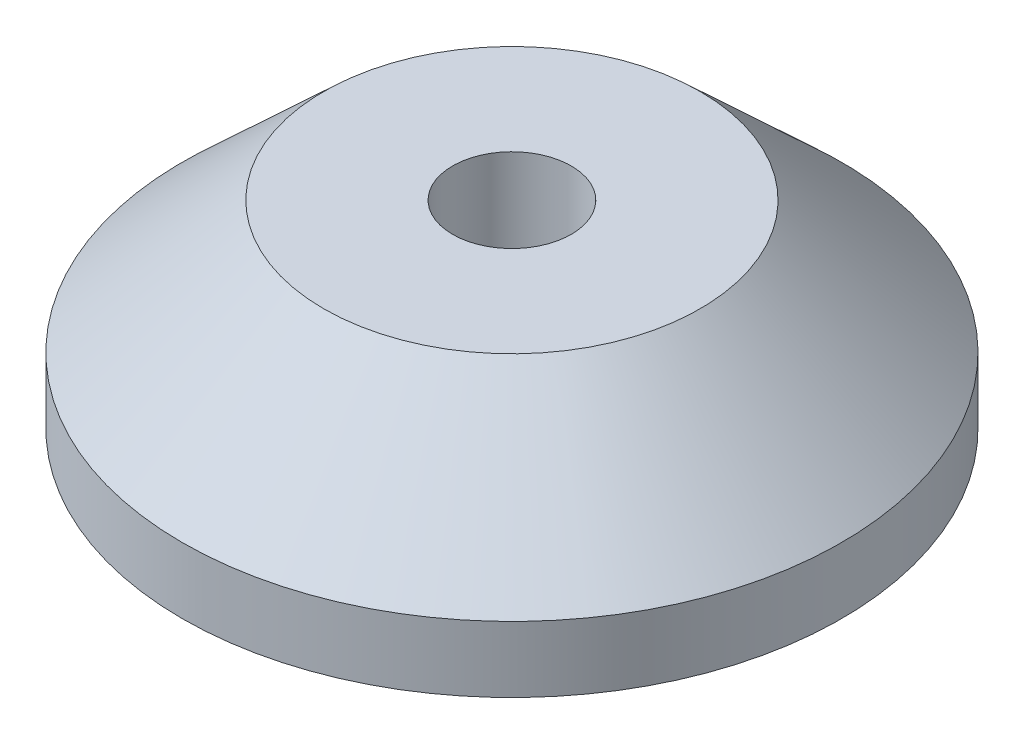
from build123d import *

# Parameters (mm, degrees)
SKETCH1_R           = 50
BOSS_EXTRUDE1_DEPTH = 10
SKETCH2_R           = 50
BOSS_EXTRUDE2_DEPTH = 21
BOSS_EXTRUDE2_TAPER = 47
SKETCH3_R           = 9
CUT_EXTRUDE1_DEPTH  = 20
SKETCH7_R           = 37.629026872
CUT_EXTRUDE2_DEPTH  = 1


with BuildPart() as part:
    # Sketch1 → Boss-Extrude1 (new body)
    with BuildSketch(Plane(origin=(0, 0, 0), x_dir=(1, 0, 0), z_dir=(0, 1, 0))):
        with Locations(Location((0, 0, 0), (0, 0, 270))):
            Circle(SKETCH1_R)
    extrude(amount=BOSS_EXTRUDE1_DEPTH)

    # Sketch2 → Boss-Extrude2 (add)
    with BuildSketch(Plane(origin=(0, 10, 0), x_dir=(1, 0, 0), z_dir=(0, 1, 0))):
        with Locations(Location((0, 0, 0), (0, 0, 270))):
            Circle(SKETCH2_R)
    extrude(amount=BOSS_EXTRUDE2_DEPTH, taper=BOSS_EXTRUDE2_TAPER)

    # Sketch3 → Cut-Extrude1 (cut)
    with BuildSketch(Plane(origin=(0, 31, 0), x_dir=(1, 0, 0), z_dir=(0, 1, 0))):
        with Locations(Location((0, 0, 0), (0, 0, 270))):
            Circle(SKETCH3_R)
    extrude(amount=-CUT_EXTRUDE1_DEPTH, mode=Mode.SUBTRACT)

    # Sketch7 → Cut-Extrude2 (cut)
    with BuildSketch(Plane(origin=(0, 31, 0), x_dir=(1, 0, 0), z_dir=(0, 1, 0))):
        Circle(SKETCH7_R)
    extrude(amount=-CUT_EXTRUDE2_DEPTH, mode=Mode.SUBTRACT)


solid = part.part
